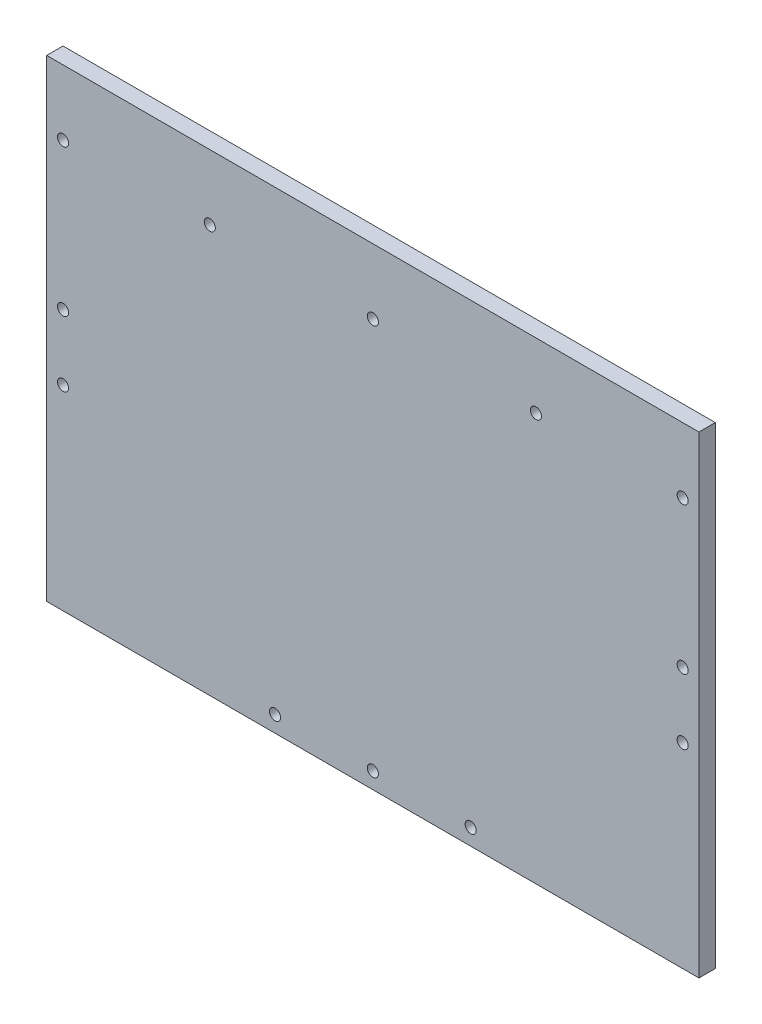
ISO-10303-21;
HEADER;
FILE_DESCRIPTION(('STEP AP214'),'2;1');
FILE_NAME('part.step','',(''),(''),'','','');
FILE_SCHEMA(('AUTOMOTIVE_DESIGN { 1 0 10303 214 1 1 1 1 }'));
ENDSEC;
DATA;
#1=APPLICATION_CONTEXT('core data for automotive mechanical design processes');
#2=APPLICATION_PROTOCOL_DEFINITION('international standard','automotive_design',2000,#1);
#3=PRODUCT_CONTEXT('',#1,'mechanical');
#4=PRODUCT('Part','Part','',(#3));
#5=PRODUCT_RELATED_PRODUCT_CATEGORY('part','',(#4));
#6=PRODUCT_DEFINITION_FORMATION('','',#4);
#7=PRODUCT_DEFINITION_CONTEXT('part definition',#1,'design');
#8=PRODUCT_DEFINITION('design','',#6,#7);
#9=PRODUCT_DEFINITION_SHAPE('','',#8);
#10=(LENGTH_UNIT() NAMED_UNIT(*) SI_UNIT(.MILLI.,.METRE.));
#11=(NAMED_UNIT(*) PLANE_ANGLE_UNIT() SI_UNIT($,.RADIAN.));
#12=(NAMED_UNIT(*) SI_UNIT($,.STERADIAN.) SOLID_ANGLE_UNIT());
#13=UNCERTAINTY_MEASURE_WITH_UNIT(LENGTH_MEASURE(1.E-05),#10,'distance_accuracy_value','');
#14=(GEOMETRIC_REPRESENTATION_CONTEXT(3) GLOBAL_UNCERTAINTY_ASSIGNED_CONTEXT((#13)) GLOBAL_UNIT_ASSIGNED_CONTEXT((#10,
#11,#12)) REPRESENTATION_CONTEXT('',''));
#15=CARTESIAN_POINT('',(0.,0.,0.));
#16=DIRECTION('',(0.,0.,1.));
#17=DIRECTION('',(1.,0.,0.));
#18=AXIS2_PLACEMENT_3D('',#15,#16,#17);
#19=CARTESIAN_POINT('',(0.,0.,0.));
#20=DIRECTION('',(0.,0.,1.));
#21=DIRECTION('',(1.,0.,0.));
#22=AXIS2_PLACEMENT_3D('',#19,#20,#21);
#23=PLANE('',#22);
#24=CARTESIAN_POINT('',(30.,-67.5,0.));
#25=DIRECTION('',(0.,0.,-1.));
#26=DIRECTION('',(-1.,0.,0.));
#27=AXIS2_PLACEMENT_3D('',#24,#25,#26);
#28=CIRCLE('',#27,3.3);
#29=CARTESIAN_POINT('',(26.7,-67.5,0.));
#30=VERTEX_POINT('',#29);
#31=EDGE_CURVE('E636',#30,#30,#28,.T.);
#32=ORIENTED_EDGE('',*,*,#31,.F.);
#33=EDGE_LOOP('',(#32));
#34=FACE_BOUND('',#33,.T.);
#35=CARTESIAN_POINT('',(0.,-67.5,0.));
#36=DIRECTION('',(0.,0.,-1.));
#37=DIRECTION('',(-1.,0.,0.));
#38=AXIS2_PLACEMENT_3D('',#35,#36,#37);
#39=CIRCLE('',#38,3.3);
#40=CARTESIAN_POINT('',(-3.3,-67.5,0.));
#41=VERTEX_POINT('',#40);
#42=EDGE_CURVE('E171',#41,#41,#39,.T.);
#43=ORIENTED_EDGE('',*,*,#42,.F.);
#44=EDGE_LOOP('',(#43));
#45=FACE_BOUND('',#44,.T.);
#46=CARTESIAN_POINT('',(-30.,-67.5,0.));
#47=DIRECTION('',(0.,0.,-1.));
#48=DIRECTION('',(-1.,0.,0.));
#49=AXIS2_PLACEMENT_3D('',#46,#47,#48);
#50=CIRCLE('',#49,3.3);
#51=CARTESIAN_POINT('',(-33.3,-67.5,0.));
#52=VERTEX_POINT('',#51);
#53=EDGE_CURVE('E164',#52,#52,#50,.T.);
#54=ORIENTED_EDGE('',*,*,#53,.F.);
#55=EDGE_LOOP('',(#54));
#56=FACE_BOUND('',#55,.T.);
#57=CARTESIAN_POINT('',(95.,7.49999999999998,0.));
#58=DIRECTION('',(0.,0.,-1.));
#59=DIRECTION('',(-1.,0.,0.));
#60=AXIS2_PLACEMENT_3D('',#57,#58,#59);
#61=CIRCLE('',#60,3.3);
#62=CARTESIAN_POINT('',(91.7,7.49999999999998,0.));
#63=VERTEX_POINT('',#62);
#64=EDGE_CURVE('E160',#63,#63,#61,.T.);
#65=ORIENTED_EDGE('',*,*,#64,.F.);
#66=EDGE_LOOP('',(#65));
#67=FACE_BOUND('',#66,.T.);
#68=CARTESIAN_POINT('',(95.,-12.5,0.));
#69=DIRECTION('',(0.,0.,-1.));
#70=DIRECTION('',(-1.,0.,0.));
#71=AXIS2_PLACEMENT_3D('',#68,#69,#70);
#72=CIRCLE('',#71,3.3);
#73=CARTESIAN_POINT('',(91.7,-12.5,0.));
#74=VERTEX_POINT('',#73);
#75=EDGE_CURVE('E156',#74,#74,#72,.T.);
#76=ORIENTED_EDGE('',*,*,#75,.F.);
#77=EDGE_LOOP('',(#76));
#78=FACE_BOUND('',#77,.T.);
#79=CARTESIAN_POINT('',(-95.,7.49999999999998,0.));
#80=DIRECTION('',(0.,0.,-1.));
#81=DIRECTION('',(-1.,0.,0.));
#82=AXIS2_PLACEMENT_3D('',#79,#80,#81);
#83=CIRCLE('',#82,3.3);
#84=CARTESIAN_POINT('',(-98.3,7.49999999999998,0.));
#85=VERTEX_POINT('',#84);
#86=EDGE_CURVE('E151',#85,#85,#83,.T.);
#87=ORIENTED_EDGE('',*,*,#86,.F.);
#88=EDGE_LOOP('',(#87));
#89=FACE_BOUND('',#88,.T.);
#90=CARTESIAN_POINT('',(-95.,-12.5,0.));
#91=DIRECTION('',(0.,0.,-1.));
#92=DIRECTION('',(-1.,0.,0.));
#93=AXIS2_PLACEMENT_3D('',#90,#91,#92);
#94=CIRCLE('',#93,3.3);
#95=CARTESIAN_POINT('',(-98.3,-12.5,0.));
#96=VERTEX_POINT('',#95);
#97=EDGE_CURVE('E146',#96,#96,#94,.T.);
#98=ORIENTED_EDGE('',*,*,#97,.F.);
#99=EDGE_LOOP('',(#98));
#100=FACE_BOUND('',#99,.T.);
#101=CARTESIAN_POINT('',(95.,52.5,0.));
#102=DIRECTION('',(0.,0.,-1.));
#103=DIRECTION('',(-1.,0.,0.));
#104=AXIS2_PLACEMENT_3D('',#101,#102,#103);
#105=CIRCLE('',#104,3.3);
#106=CARTESIAN_POINT('',(91.7,52.5,0.));
#107=VERTEX_POINT('',#106);
#108=EDGE_CURVE('E141',#107,#107,#105,.T.);
#109=ORIENTED_EDGE('',*,*,#108,.F.);
#110=EDGE_LOOP('',(#109));
#111=FACE_BOUND('',#110,.T.);
#112=CARTESIAN_POINT('',(50.,52.5,0.));
#113=DIRECTION('',(0.,0.,-1.));
#114=DIRECTION('',(-1.,0.,0.));
#115=AXIS2_PLACEMENT_3D('',#112,#113,#114);
#116=CIRCLE('',#115,3.3);
#117=CARTESIAN_POINT('',(46.7,52.5,0.));
#118=VERTEX_POINT('',#117);
#119=EDGE_CURVE('E136',#118,#118,#116,.T.);
#120=ORIENTED_EDGE('',*,*,#119,.F.);
#121=EDGE_LOOP('',(#120));
#122=FACE_BOUND('',#121,.T.);
#123=CARTESIAN_POINT('',(-95.,52.5,0.));
#124=DIRECTION('',(0.,0.,-1.));
#125=DIRECTION('',(-1.,0.,0.));
#126=AXIS2_PLACEMENT_3D('',#123,#124,#125);
#127=CIRCLE('',#126,3.3);
#128=CARTESIAN_POINT('',(-98.3,52.5,0.));
#129=VERTEX_POINT('',#128);
#130=EDGE_CURVE('E126',#129,#129,#127,.T.);
#131=ORIENTED_EDGE('',*,*,#130,.F.);
#132=EDGE_LOOP('',(#131));
#133=FACE_BOUND('',#132,.T.);
#134=CARTESIAN_POINT('',(0.,52.5,0.));
#135=DIRECTION('',(0.,0.,-1.));
#136=DIRECTION('',(-1.,0.,0.));
#137=AXIS2_PLACEMENT_3D('',#134,#135,#136);
#138=CIRCLE('',#137,3.3);
#139=CARTESIAN_POINT('',(-3.29999999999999,52.5,0.));
#140=VERTEX_POINT('',#139);
#141=EDGE_CURVE('E121',#140,#140,#138,.T.);
#142=ORIENTED_EDGE('',*,*,#141,.F.);
#143=EDGE_LOOP('',(#142));
#144=FACE_BOUND('',#143,.T.);
#145=DIRECTION('',(0.,1.,0.));
#146=VECTOR('',#145,1.);
#147=CARTESIAN_POINT('',(100.,72.5,0.));
#148=LINE('',#147,#146);
#149=CARTESIAN_POINT('',(100.,-72.5,0.));
#150=VERTEX_POINT('',#149);
#151=CARTESIAN_POINT('',(100.,72.5,0.));
#152=VERTEX_POINT('',#151);
#153=EDGE_CURVE('E106',#150,#152,#148,.T.);
#154=ORIENTED_EDGE('',*,*,#153,.F.);
#155=DIRECTION('',(1.,0.,0.));
#156=VECTOR('',#155,1.);
#157=CARTESIAN_POINT('',(-100.,-72.5,0.));
#158=LINE('',#157,#156);
#159=CARTESIAN_POINT('',(-100.,-72.5,0.));
#160=VERTEX_POINT('',#159);
#161=EDGE_CURVE('E81',#160,#150,#158,.T.);
#162=ORIENTED_EDGE('',*,*,#161,.F.);
#163=DIRECTION('',(0.,-1.,0.));
#164=VECTOR('',#163,1.);
#165=CARTESIAN_POINT('',(-100.,72.5,0.));
#166=LINE('',#165,#164);
#167=CARTESIAN_POINT('',(-100.,72.5,0.));
#168=VERTEX_POINT('',#167);
#169=EDGE_CURVE('E75',#168,#160,#166,.T.);
#170=ORIENTED_EDGE('',*,*,#169,.F.);
#171=DIRECTION('',(-1.,0.,0.));
#172=VECTOR('',#171,1.);
#173=CARTESIAN_POINT('',(-100.,72.5,0.));
#174=LINE('',#173,#172);
#175=EDGE_CURVE('E97',#152,#168,#174,.T.);
#176=ORIENTED_EDGE('',*,*,#175,.F.);
#177=EDGE_LOOP('',(#154,#162,#170,#176));
#178=FACE_BOUND('',#177,.T.);
#179=CARTESIAN_POINT('',(-50.,52.5,0.));
#180=DIRECTION('',(0.,0.,-1.));
#181=DIRECTION('',(-1.,0.,0.));
#182=AXIS2_PLACEMENT_3D('',#179,#180,#181);
#183=CIRCLE('',#182,3.3);
#184=CARTESIAN_POINT('',(-53.3,52.5,0.));
#185=VERTEX_POINT('',#184);
#186=EDGE_CURVE('E131',#185,#185,#183,.T.);
#187=ORIENTED_EDGE('',*,*,#186,.F.);
#188=EDGE_LOOP('',(#187));
#189=FACE_BOUND('',#188,.T.);
#190=ADVANCED_FACE('F39',(#34,#45,#56,#67,#78,#89,#100,#111,#122,#133,#144,#178,#189),#23,.F.);
#191=CARTESIAN_POINT('',(100.,72.5,5.));
#192=DIRECTION('',(-1.,0.,0.));
#193=DIRECTION('',(0.,0.,1.));
#194=AXIS2_PLACEMENT_3D('',#191,#192,#193);
#195=PLANE('',#194);
#196=ORIENTED_EDGE('',*,*,#153,.T.);
#197=DIRECTION('',(0.,0.,-1.));
#198=VECTOR('',#197,1.);
#199=CARTESIAN_POINT('',(100.,72.5,5.));
#200=LINE('',#199,#198);
#201=CARTESIAN_POINT('',(100.,72.5,5.));
#202=VERTEX_POINT('',#201);
#203=EDGE_CURVE('E11',#202,#152,#200,.T.);
#204=ORIENTED_EDGE('',*,*,#203,.F.);
#205=DIRECTION('',(0.,1.,0.));
#206=VECTOR('',#205,1.);
#207=CARTESIAN_POINT('',(100.,72.5,5.));
#208=LINE('',#207,#206);
#209=CARTESIAN_POINT('',(100.,-72.5,5.));
#210=VERTEX_POINT('',#209);
#211=EDGE_CURVE('E93',#210,#202,#208,.T.);
#212=ORIENTED_EDGE('',*,*,#211,.F.);
#213=DIRECTION('',(0.,0.,-1.));
#214=VECTOR('',#213,1.);
#215=CARTESIAN_POINT('',(100.,-72.5,5.));
#216=LINE('',#215,#214);
#217=EDGE_CURVE('E102',#210,#150,#216,.T.);
#218=ORIENTED_EDGE('',*,*,#217,.T.);
#219=EDGE_LOOP('',(#196,#204,#212,#218));
#220=FACE_BOUND('',#219,.T.);
#221=ADVANCED_FACE('F41',(#220),#195,.F.);
#222=CARTESIAN_POINT('',(-100.,72.5,5.));
#223=DIRECTION('',(0.,-1.,0.));
#224=DIRECTION('',(0.,0.,-1.));
#225=AXIS2_PLACEMENT_3D('',#222,#223,#224);
#226=PLANE('',#225);
#227=ORIENTED_EDGE('',*,*,#175,.T.);
#228=DIRECTION('',(0.,0.,-1.));
#229=VECTOR('',#228,1.);
#230=CARTESIAN_POINT('',(-100.,72.5,5.));
#231=LINE('',#230,#229);
#232=CARTESIAN_POINT('',(-100.,72.5,5.));
#233=VERTEX_POINT('',#232);
#234=EDGE_CURVE('E49',#233,#168,#231,.T.);
#235=ORIENTED_EDGE('',*,*,#234,.F.);
#236=DIRECTION('',(-1.,0.,0.));
#237=VECTOR('',#236,1.);
#238=CARTESIAN_POINT('',(-100.,72.5,5.));
#239=LINE('',#238,#237);
#240=EDGE_CURVE('E88',#202,#233,#239,.T.);
#241=ORIENTED_EDGE('',*,*,#240,.F.);
#242=ORIENTED_EDGE('',*,*,#203,.T.);
#243=EDGE_LOOP('',(#227,#235,#241,#242));
#244=FACE_BOUND('',#243,.T.);
#245=ADVANCED_FACE('F96',(#244),#226,.F.);
#246=CARTESIAN_POINT('',(-100.,72.5,5.));
#247=DIRECTION('',(1.,0.,0.));
#248=DIRECTION('',(0.,1.,0.));
#249=AXIS2_PLACEMENT_3D('',#246,#247,#248);
#250=PLANE('',#249);
#251=ORIENTED_EDGE('',*,*,#169,.T.);
#252=DIRECTION('',(0.,0.,-1.));
#253=VECTOR('',#252,1.);
#254=CARTESIAN_POINT('',(-100.,-72.5,5.));
#255=LINE('',#254,#253);
#256=CARTESIAN_POINT('',(-100.,-72.5,5.));
#257=VERTEX_POINT('',#256);
#258=EDGE_CURVE('E98',#257,#160,#255,.T.);
#259=ORIENTED_EDGE('',*,*,#258,.F.);
#260=DIRECTION('',(0.,-1.,0.));
#261=VECTOR('',#260,1.);
#262=CARTESIAN_POINT('',(-100.,72.5,5.));
#263=LINE('',#262,#261);
#264=EDGE_CURVE('E91',#233,#257,#263,.T.);
#265=ORIENTED_EDGE('',*,*,#264,.F.);
#266=ORIENTED_EDGE('',*,*,#234,.T.);
#267=EDGE_LOOP('',(#251,#259,#265,#266));
#268=FACE_BOUND('',#267,.T.);
#269=ADVANCED_FACE('F100',(#268),#250,.F.);
#270=CARTESIAN_POINT('',(-100.,-72.5,5.));
#271=DIRECTION('',(0.,1.,0.));
#272=DIRECTION('',(0.,0.,1.));
#273=AXIS2_PLACEMENT_3D('',#270,#271,#272);
#274=PLANE('',#273);
#275=ORIENTED_EDGE('',*,*,#161,.T.);
#276=ORIENTED_EDGE('',*,*,#217,.F.);
#277=DIRECTION('',(1.,0.,0.));
#278=VECTOR('',#277,1.);
#279=CARTESIAN_POINT('',(-100.,-72.5,5.));
#280=LINE('',#279,#278);
#281=EDGE_CURVE('E58',#257,#210,#280,.T.);
#282=ORIENTED_EDGE('',*,*,#281,.F.);
#283=ORIENTED_EDGE('',*,*,#258,.T.);
#284=EDGE_LOOP('',(#275,#276,#282,#283));
#285=FACE_BOUND('',#284,.T.);
#286=ADVANCED_FACE('F264',(#285),#274,.F.);
#287=CARTESIAN_POINT('',(0.,0.,5.));
#288=DIRECTION('',(0.,0.,1.));
#289=DIRECTION('',(1.,0.,0.));
#290=AXIS2_PLACEMENT_3D('',#287,#288,#289);
#291=PLANE('',#290);
#292=CARTESIAN_POINT('',(30.,-67.5,5.));
#293=DIRECTION('',(0.,0.,1.));
#294=DIRECTION('',(1.,0.,0.));
#295=AXIS2_PLACEMENT_3D('',#292,#293,#294);
#296=CIRCLE('',#295,1.69999999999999);
#297=CARTESIAN_POINT('',(31.7,-67.5,5.));
#298=VERTEX_POINT('',#297);
#299=EDGE_CURVE('E43',#298,#298,#296,.T.);
#300=ORIENTED_EDGE('',*,*,#299,.F.);
#301=EDGE_LOOP('',(#300));
#302=FACE_BOUND('',#301,.T.);
#303=CARTESIAN_POINT('',(0.,-67.5,5.));
#304=DIRECTION('',(0.,0.,1.));
#305=DIRECTION('',(1.,0.,0.));
#306=AXIS2_PLACEMENT_3D('',#303,#304,#305);
#307=CIRCLE('',#306,1.69999999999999);
#308=CARTESIAN_POINT('',(1.69999999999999,-67.5,5.));
#309=VERTEX_POINT('',#308);
#310=EDGE_CURVE('E162',#309,#309,#307,.T.);
#311=ORIENTED_EDGE('',*,*,#310,.F.);
#312=EDGE_LOOP('',(#311));
#313=FACE_BOUND('',#312,.T.);
#314=CARTESIAN_POINT('',(-30.,-67.5,5.));
#315=DIRECTION('',(0.,0.,1.));
#316=DIRECTION('',(1.,0.,0.));
#317=AXIS2_PLACEMENT_3D('',#314,#315,#316);
#318=CIRCLE('',#317,1.69999999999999);
#319=CARTESIAN_POINT('',(-28.3,-67.5,5.));
#320=VERTEX_POINT('',#319);
#321=EDGE_CURVE('E158',#320,#320,#318,.T.);
#322=ORIENTED_EDGE('',*,*,#321,.F.);
#323=EDGE_LOOP('',(#322));
#324=FACE_BOUND('',#323,.T.);
#325=CARTESIAN_POINT('',(95.,7.49999999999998,5.));
#326=DIRECTION('',(0.,0.,1.));
#327=DIRECTION('',(1.,0.,0.));
#328=AXIS2_PLACEMENT_3D('',#325,#326,#327);
#329=CIRCLE('',#328,1.69999999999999);
#330=CARTESIAN_POINT('',(96.7,7.49999999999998,5.));
#331=VERTEX_POINT('',#330);
#332=EDGE_CURVE('E153',#331,#331,#329,.T.);
#333=ORIENTED_EDGE('',*,*,#332,.F.);
#334=EDGE_LOOP('',(#333));
#335=FACE_BOUND('',#334,.T.);
#336=CARTESIAN_POINT('',(95.,-12.5,5.));
#337=DIRECTION('',(0.,0.,1.));
#338=DIRECTION('',(1.,0.,0.));
#339=AXIS2_PLACEMENT_3D('',#336,#337,#338);
#340=CIRCLE('',#339,1.69999999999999);
#341=CARTESIAN_POINT('',(96.7,-12.5,5.));
#342=VERTEX_POINT('',#341);
#343=EDGE_CURVE('E148',#342,#342,#340,.T.);
#344=ORIENTED_EDGE('',*,*,#343,.F.);
#345=EDGE_LOOP('',(#344));
#346=FACE_BOUND('',#345,.T.);
#347=CARTESIAN_POINT('',(-95.,7.49999999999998,5.));
#348=DIRECTION('',(0.,0.,1.));
#349=DIRECTION('',(1.,0.,0.));
#350=AXIS2_PLACEMENT_3D('',#347,#348,#349);
#351=CIRCLE('',#350,1.69999999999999);
#352=CARTESIAN_POINT('',(-93.3,7.49999999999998,5.));
#353=VERTEX_POINT('',#352);
#354=EDGE_CURVE('E143',#353,#353,#351,.T.);
#355=ORIENTED_EDGE('',*,*,#354,.F.);
#356=EDGE_LOOP('',(#355));
#357=FACE_BOUND('',#356,.T.);
#358=CARTESIAN_POINT('',(-95.,-12.5,5.));
#359=DIRECTION('',(0.,0.,1.));
#360=DIRECTION('',(1.,0.,0.));
#361=AXIS2_PLACEMENT_3D('',#358,#359,#360);
#362=CIRCLE('',#361,1.69999999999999);
#363=CARTESIAN_POINT('',(-93.3,-12.5,5.));
#364=VERTEX_POINT('',#363);
#365=EDGE_CURVE('E138',#364,#364,#362,.T.);
#366=ORIENTED_EDGE('',*,*,#365,.F.);
#367=EDGE_LOOP('',(#366));
#368=FACE_BOUND('',#367,.T.);
#369=CARTESIAN_POINT('',(95.,52.5,5.));
#370=DIRECTION('',(0.,0.,1.));
#371=DIRECTION('',(1.,0.,0.));
#372=AXIS2_PLACEMENT_3D('',#369,#370,#371);
#373=CIRCLE('',#372,1.69999999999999);
#374=CARTESIAN_POINT('',(96.7,52.5,5.));
#375=VERTEX_POINT('',#374);
#376=EDGE_CURVE('E133',#375,#375,#373,.T.);
#377=ORIENTED_EDGE('',*,*,#376,.F.);
#378=EDGE_LOOP('',(#377));
#379=FACE_BOUND('',#378,.T.);
#380=CARTESIAN_POINT('',(50.,52.5,5.));
#381=DIRECTION('',(0.,0.,1.));
#382=DIRECTION('',(1.,0.,0.));
#383=AXIS2_PLACEMENT_3D('',#380,#381,#382);
#384=CIRCLE('',#383,1.7);
#385=CARTESIAN_POINT('',(51.7,52.5,5.));
#386=VERTEX_POINT('',#385);
#387=EDGE_CURVE('E128',#386,#386,#384,.T.);
#388=ORIENTED_EDGE('',*,*,#387,.F.);
#389=EDGE_LOOP('',(#388));
#390=FACE_BOUND('',#389,.T.);
#391=CARTESIAN_POINT('',(-50.,52.5,5.));
#392=DIRECTION('',(0.,0.,1.));
#393=DIRECTION('',(1.,0.,0.));
#394=AXIS2_PLACEMENT_3D('',#391,#392,#393);
#395=CIRCLE('',#394,1.7);
#396=CARTESIAN_POINT('',(-48.3,52.5,5.));
#397=VERTEX_POINT('',#396);
#398=EDGE_CURVE('E123',#397,#397,#395,.T.);
#399=ORIENTED_EDGE('',*,*,#398,.F.);
#400=EDGE_LOOP('',(#399));
#401=FACE_BOUND('',#400,.T.);
#402=CARTESIAN_POINT('',(-95.,52.5,5.));
#403=DIRECTION('',(0.,0.,1.));
#404=DIRECTION('',(1.,0.,0.));
#405=AXIS2_PLACEMENT_3D('',#402,#403,#404);
#406=CIRCLE('',#405,1.69999999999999);
#407=CARTESIAN_POINT('',(-93.3,52.5,5.));
#408=VERTEX_POINT('',#407);
#409=EDGE_CURVE('E118',#408,#408,#406,.T.);
#410=ORIENTED_EDGE('',*,*,#409,.F.);
#411=EDGE_LOOP('',(#410));
#412=FACE_BOUND('',#411,.T.);
#413=CARTESIAN_POINT('',(0.,52.5,5.));
#414=DIRECTION('',(0.,0.,1.));
#415=DIRECTION('',(1.,0.,0.));
#416=AXIS2_PLACEMENT_3D('',#413,#414,#415);
#417=CIRCLE('',#416,1.7);
#418=CARTESIAN_POINT('',(1.70000000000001,52.5,5.));
#419=VERTEX_POINT('',#418);
#420=EDGE_CURVE('E109',#419,#419,#417,.T.);
#421=ORIENTED_EDGE('',*,*,#420,.F.);
#422=EDGE_LOOP('',(#421));
#423=FACE_BOUND('',#422,.T.);
#424=ORIENTED_EDGE('',*,*,#211,.T.);
#425=ORIENTED_EDGE('',*,*,#240,.T.);
#426=ORIENTED_EDGE('',*,*,#264,.T.);
#427=ORIENTED_EDGE('',*,*,#281,.T.);
#428=EDGE_LOOP('',(#424,#425,#426,#427));
#429=FACE_BOUND('',#428,.T.);
#430=ADVANCED_FACE('F89',(#302,#313,#324,#335,#346,#357,#368,#379,#390,#401,#412,#423,#429),
#291,.T.);
#431=CARTESIAN_POINT('',(0.,52.5,0.));
#432=DIRECTION('',(0.,0.,-1.));
#433=DIRECTION('',(-1.,0.,0.));
#434=AXIS2_PLACEMENT_3D('',#431,#432,#433);
#435=CYLINDRICAL_SURFACE('',#434,1.7);
#436=ORIENTED_EDGE('',*,*,#420,.T.);
#437=EDGE_LOOP('',(#436));
#438=FACE_BOUND('',#437,.T.);
#439=CARTESIAN_POINT('',(0.,52.5,1.6));
#440=DIRECTION('',(0.,0.,-1.));
#441=DIRECTION('',(-1.,0.,0.));
#442=AXIS2_PLACEMENT_3D('',#439,#440,#441);
#443=CIRCLE('',#442,1.7);
#444=CARTESIAN_POINT('',(-1.69999999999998,52.5,1.6));
#445=VERTEX_POINT('',#444);
#446=EDGE_CURVE('E117',#445,#445,#443,.T.);
#447=ORIENTED_EDGE('',*,*,#446,.T.);
#448=EDGE_LOOP('',(#447));
#449=FACE_BOUND('',#448,.T.);
#450=ADVANCED_FACE('F218',(#438,#449),#435,.F.);
#451=CARTESIAN_POINT('',(0.,52.5,0.));
#452=DIRECTION('',(0.,0.,-1.));
#453=DIRECTION('',(-1.,0.,0.));
#454=AXIS2_PLACEMENT_3D('',#451,#452,#453);
#455=CONICAL_SURFACE('',#454,3.3,0.785398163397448);
#456=ORIENTED_EDGE('',*,*,#446,.F.);
#457=EDGE_LOOP('',(#456));
#458=FACE_BOUND('',#457,.T.);
#459=ORIENTED_EDGE('',*,*,#141,.T.);
#460=EDGE_LOOP('',(#459));
#461=FACE_BOUND('',#460,.T.);
#462=ADVANCED_FACE('F220',(#458,#461),#455,.F.);
#463=CARTESIAN_POINT('',(-95.,52.5,0.));
#464=DIRECTION('',(0.,0.,-1.));
#465=DIRECTION('',(-1.,0.,0.));
#466=AXIS2_PLACEMENT_3D('',#463,#464,#465);
#467=CYLINDRICAL_SURFACE('',#466,1.69999999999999);
#468=ORIENTED_EDGE('',*,*,#409,.T.);
#469=EDGE_LOOP('',(#468));
#470=FACE_BOUND('',#469,.T.);
#471=CARTESIAN_POINT('',(-95.,52.5,1.6));
#472=DIRECTION('',(0.,0.,-1.));
#473=DIRECTION('',(-1.,0.,0.));
#474=AXIS2_PLACEMENT_3D('',#471,#472,#473);
#475=CIRCLE('',#474,1.69999999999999);
#476=CARTESIAN_POINT('',(-96.7,52.5,1.6));
#477=VERTEX_POINT('',#476);
#478=EDGE_CURVE('E122',#477,#477,#475,.T.);
#479=ORIENTED_EDGE('',*,*,#478,.T.);
#480=EDGE_LOOP('',(#479));
#481=FACE_BOUND('',#480,.T.);
#482=ADVANCED_FACE('F223',(#470,#481),#467,.F.);
#483=CARTESIAN_POINT('',(-95.,52.5,0.));
#484=DIRECTION('',(0.,0.,-1.));
#485=DIRECTION('',(-1.,0.,0.));
#486=AXIS2_PLACEMENT_3D('',#483,#484,#485);
#487=CONICAL_SURFACE('',#486,3.3,0.785398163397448);
#488=ORIENTED_EDGE('',*,*,#478,.F.);
#489=EDGE_LOOP('',(#488));
#490=FACE_BOUND('',#489,.T.);
#491=ORIENTED_EDGE('',*,*,#130,.T.);
#492=EDGE_LOOP('',(#491));
#493=FACE_BOUND('',#492,.T.);
#494=ADVANCED_FACE('F248',(#490,#493),#487,.F.);
#495=CARTESIAN_POINT('',(-50.,52.5,0.));
#496=DIRECTION('',(0.,0.,-1.));
#497=DIRECTION('',(-1.,0.,0.));
#498=AXIS2_PLACEMENT_3D('',#495,#496,#497);
#499=CYLINDRICAL_SURFACE('',#498,1.7);
#500=ORIENTED_EDGE('',*,*,#398,.T.);
#501=EDGE_LOOP('',(#500));
#502=FACE_BOUND('',#501,.T.);
#503=CARTESIAN_POINT('',(-50.,52.5,1.6));
#504=DIRECTION('',(0.,0.,-1.));
#505=DIRECTION('',(-1.,0.,0.));
#506=AXIS2_PLACEMENT_3D('',#503,#504,#505);
#507=CIRCLE('',#506,1.7);
#508=CARTESIAN_POINT('',(-51.7,52.5,1.6));
#509=VERTEX_POINT('',#508);
#510=EDGE_CURVE('E127',#509,#509,#507,.T.);
#511=ORIENTED_EDGE('',*,*,#510,.T.);
#512=EDGE_LOOP('',(#511));
#513=FACE_BOUND('',#512,.T.);
#514=ADVANCED_FACE('F238',(#502,#513),#499,.F.);
#515=CARTESIAN_POINT('',(-50.,52.5,0.));
#516=DIRECTION('',(0.,0.,-1.));
#517=DIRECTION('',(-1.,0.,0.));
#518=AXIS2_PLACEMENT_3D('',#515,#516,#517);
#519=CONICAL_SURFACE('',#518,3.3,0.785398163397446);
#520=ORIENTED_EDGE('',*,*,#510,.F.);
#521=EDGE_LOOP('',(#520));
#522=FACE_BOUND('',#521,.T.);
#523=ORIENTED_EDGE('',*,*,#186,.T.);
#524=EDGE_LOOP('',(#523));
#525=FACE_BOUND('',#524,.T.);
#526=ADVANCED_FACE('F235',(#522,#525),#519,.F.);
#527=CARTESIAN_POINT('',(50.,52.5,0.));
#528=DIRECTION('',(0.,0.,-1.));
#529=DIRECTION('',(-1.,0.,0.));
#530=AXIS2_PLACEMENT_3D('',#527,#528,#529);
#531=CYLINDRICAL_SURFACE('',#530,1.7);
#532=ORIENTED_EDGE('',*,*,#387,.T.);
#533=EDGE_LOOP('',(#532));
#534=FACE_BOUND('',#533,.T.);
#535=CARTESIAN_POINT('',(50.,52.5,1.6));
#536=DIRECTION('',(0.,0.,-1.));
#537=DIRECTION('',(-1.,0.,0.));
#538=AXIS2_PLACEMENT_3D('',#535,#536,#537);
#539=CIRCLE('',#538,1.7);
#540=CARTESIAN_POINT('',(48.3,52.5,1.6));
#541=VERTEX_POINT('',#540);
#542=EDGE_CURVE('E132',#541,#541,#539,.T.);
#543=ORIENTED_EDGE('',*,*,#542,.T.);
#544=EDGE_LOOP('',(#543));
#545=FACE_BOUND('',#544,.T.);
#546=ADVANCED_FACE('F237',(#534,#545),#531,.F.);
#547=CARTESIAN_POINT('',(50.,52.5,0.));
#548=DIRECTION('',(0.,0.,-1.));
#549=DIRECTION('',(-1.,0.,0.));
#550=AXIS2_PLACEMENT_3D('',#547,#548,#549);
#551=CONICAL_SURFACE('',#550,3.3,0.785398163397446);
#552=ORIENTED_EDGE('',*,*,#542,.F.);
#553=EDGE_LOOP('',(#552));
#554=FACE_BOUND('',#553,.T.);
#555=ORIENTED_EDGE('',*,*,#119,.T.);
#556=EDGE_LOOP('',(#555));
#557=FACE_BOUND('',#556,.T.);
#558=ADVANCED_FACE('F245',(#554,#557),#551,.F.);
#559=CARTESIAN_POINT('',(95.,52.5,0.));
#560=DIRECTION('',(0.,0.,-1.));
#561=DIRECTION('',(-1.,0.,0.));
#562=AXIS2_PLACEMENT_3D('',#559,#560,#561);
#563=CYLINDRICAL_SURFACE('',#562,1.69999999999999);
#564=ORIENTED_EDGE('',*,*,#376,.T.);
#565=EDGE_LOOP('',(#564));
#566=FACE_BOUND('',#565,.T.);
#567=CARTESIAN_POINT('',(95.,52.5,1.6));
#568=DIRECTION('',(0.,0.,-1.));
#569=DIRECTION('',(-1.,0.,0.));
#570=AXIS2_PLACEMENT_3D('',#567,#568,#569);
#571=CIRCLE('',#570,1.69999999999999);
#572=CARTESIAN_POINT('',(93.3,52.5,1.6));
#573=VERTEX_POINT('',#572);
#574=EDGE_CURVE('E137',#573,#573,#571,.T.);
#575=ORIENTED_EDGE('',*,*,#574,.T.);
#576=EDGE_LOOP('',(#575));
#577=FACE_BOUND('',#576,.T.);
#578=ADVANCED_FACE('F452',(#566,#577),#563,.F.);
#579=CARTESIAN_POINT('',(95.,52.5,0.));
#580=DIRECTION('',(0.,0.,-1.));
#581=DIRECTION('',(-1.,0.,0.));
#582=AXIS2_PLACEMENT_3D('',#579,#580,#581);
#583=CONICAL_SURFACE('',#582,3.3,0.785398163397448);
#584=ORIENTED_EDGE('',*,*,#574,.F.);
#585=EDGE_LOOP('',(#584));
#586=FACE_BOUND('',#585,.T.);
#587=ORIENTED_EDGE('',*,*,#108,.T.);
#588=EDGE_LOOP('',(#587));
#589=FACE_BOUND('',#588,.T.);
#590=ADVANCED_FACE('F442',(#586,#589),#583,.F.);
#591=CARTESIAN_POINT('',(-95.,-12.5,0.));
#592=DIRECTION('',(0.,0.,-1.));
#593=DIRECTION('',(-1.,0.,0.));
#594=AXIS2_PLACEMENT_3D('',#591,#592,#593);
#595=CYLINDRICAL_SURFACE('',#594,1.69999999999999);
#596=ORIENTED_EDGE('',*,*,#365,.T.);
#597=EDGE_LOOP('',(#596));
#598=FACE_BOUND('',#597,.T.);
#599=CARTESIAN_POINT('',(-95.,-12.5,1.60000000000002));
#600=DIRECTION('',(0.,0.,-1.));
#601=DIRECTION('',(-1.,0.,0.));
#602=AXIS2_PLACEMENT_3D('',#599,#600,#601);
#603=CIRCLE('',#602,1.69999999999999);
#604=CARTESIAN_POINT('',(-96.7,-12.5,1.60000000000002));
#605=VERTEX_POINT('',#604);
#606=EDGE_CURVE('E142',#605,#605,#603,.T.);
#607=ORIENTED_EDGE('',*,*,#606,.T.);
#608=EDGE_LOOP('',(#607));
#609=FACE_BOUND('',#608,.T.);
#610=ADVANCED_FACE('F432',(#598,#609),#595,.F.);
#611=CARTESIAN_POINT('',(-95.,-12.5,0.));
#612=DIRECTION('',(0.,0.,-1.));
#613=DIRECTION('',(-1.,0.,0.));
#614=AXIS2_PLACEMENT_3D('',#611,#612,#613);
#615=CONICAL_SURFACE('',#614,3.3,0.785398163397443);
#616=ORIENTED_EDGE('',*,*,#606,.F.);
#617=EDGE_LOOP('',(#616));
#618=FACE_BOUND('',#617,.T.);
#619=ORIENTED_EDGE('',*,*,#97,.T.);
#620=EDGE_LOOP('',(#619));
#621=FACE_BOUND('',#620,.T.);
#622=ADVANCED_FACE('F422',(#618,#621),#615,.F.);
#623=CARTESIAN_POINT('',(-95.,7.49999999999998,0.));
#624=DIRECTION('',(0.,0.,-1.));
#625=DIRECTION('',(-1.,0.,0.));
#626=AXIS2_PLACEMENT_3D('',#623,#624,#625);
#627=CYLINDRICAL_SURFACE('',#626,1.69999999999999);
#628=ORIENTED_EDGE('',*,*,#354,.T.);
#629=EDGE_LOOP('',(#628));
#630=FACE_BOUND('',#629,.T.);
#631=CARTESIAN_POINT('',(-95.,7.49999999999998,1.60000000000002));
#632=DIRECTION('',(0.,0.,-1.));
#633=DIRECTION('',(-1.,0.,0.));
#634=AXIS2_PLACEMENT_3D('',#631,#632,#633);
#635=CIRCLE('',#634,1.69999999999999);
#636=CARTESIAN_POINT('',(-96.7,7.49999999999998,1.60000000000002));
#637=VERTEX_POINT('',#636);
#638=EDGE_CURVE('E147',#637,#637,#635,.T.);
#639=ORIENTED_EDGE('',*,*,#638,.T.);
#640=EDGE_LOOP('',(#639));
#641=FACE_BOUND('',#640,.T.);
#642=ADVANCED_FACE('F412',(#630,#641),#627,.F.);
#643=CARTESIAN_POINT('',(-95.,7.49999999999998,0.));
#644=DIRECTION('',(0.,0.,-1.));
#645=DIRECTION('',(-1.,0.,0.));
#646=AXIS2_PLACEMENT_3D('',#643,#644,#645);
#647=CONICAL_SURFACE('',#646,3.3,0.785398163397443);
#648=ORIENTED_EDGE('',*,*,#638,.F.);
#649=EDGE_LOOP('',(#648));
#650=FACE_BOUND('',#649,.T.);
#651=ORIENTED_EDGE('',*,*,#86,.T.);
#652=EDGE_LOOP('',(#651));
#653=FACE_BOUND('',#652,.T.);
#654=ADVANCED_FACE('F402',(#650,#653),#647,.F.);
#655=CARTESIAN_POINT('',(95.,-12.5,0.));
#656=DIRECTION('',(0.,0.,-1.));
#657=DIRECTION('',(-1.,0.,0.));
#658=AXIS2_PLACEMENT_3D('',#655,#656,#657);
#659=CYLINDRICAL_SURFACE('',#658,1.69999999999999);
#660=ORIENTED_EDGE('',*,*,#343,.T.);
#661=EDGE_LOOP('',(#660));
#662=FACE_BOUND('',#661,.T.);
#663=CARTESIAN_POINT('',(95.,-12.5,1.60000000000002));
#664=DIRECTION('',(0.,0.,-1.));
#665=DIRECTION('',(-1.,0.,0.));
#666=AXIS2_PLACEMENT_3D('',#663,#664,#665);
#667=CIRCLE('',#666,1.69999999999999);
#668=CARTESIAN_POINT('',(93.3,-12.5,1.60000000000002));
#669=VERTEX_POINT('',#668);
#670=EDGE_CURVE('E152',#669,#669,#667,.T.);
#671=ORIENTED_EDGE('',*,*,#670,.T.);
#672=EDGE_LOOP('',(#671));
#673=FACE_BOUND('',#672,.T.);
#674=ADVANCED_FACE('F392',(#662,#673),#659,.F.);
#675=CARTESIAN_POINT('',(95.,-12.5,0.));
#676=DIRECTION('',(0.,0.,-1.));
#677=DIRECTION('',(-1.,0.,0.));
#678=AXIS2_PLACEMENT_3D('',#675,#676,#677);
#679=CONICAL_SURFACE('',#678,3.3,0.785398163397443);
#680=ORIENTED_EDGE('',*,*,#670,.F.);
#681=EDGE_LOOP('',(#680));
#682=FACE_BOUND('',#681,.T.);
#683=ORIENTED_EDGE('',*,*,#75,.T.);
#684=EDGE_LOOP('',(#683));
#685=FACE_BOUND('',#684,.T.);
#686=ADVANCED_FACE('F383',(#682,#685),#679,.F.);
#687=CARTESIAN_POINT('',(95.,7.49999999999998,0.));
#688=DIRECTION('',(0.,0.,-1.));
#689=DIRECTION('',(-1.,0.,0.));
#690=AXIS2_PLACEMENT_3D('',#687,#688,#689);
#691=CYLINDRICAL_SURFACE('',#690,1.69999999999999);
#692=ORIENTED_EDGE('',*,*,#332,.T.);
#693=EDGE_LOOP('',(#692));
#694=FACE_BOUND('',#693,.T.);
#695=CARTESIAN_POINT('',(95.,7.49999999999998,1.60000000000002));
#696=DIRECTION('',(0.,0.,-1.));
#697=DIRECTION('',(-1.,0.,0.));
#698=AXIS2_PLACEMENT_3D('',#695,#696,#697);
#699=CIRCLE('',#698,1.69999999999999);
#700=CARTESIAN_POINT('',(93.3,7.49999999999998,1.60000000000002));
#701=VERTEX_POINT('',#700);
#702=EDGE_CURVE('E157',#701,#701,#699,.T.);
#703=ORIENTED_EDGE('',*,*,#702,.T.);
#704=EDGE_LOOP('',(#703));
#705=FACE_BOUND('',#704,.T.);
#706=ADVANCED_FACE('F374',(#694,#705),#691,.F.);
#707=CARTESIAN_POINT('',(95.,7.49999999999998,0.));
#708=DIRECTION('',(0.,0.,-1.));
#709=DIRECTION('',(-1.,0.,0.));
#710=AXIS2_PLACEMENT_3D('',#707,#708,#709);
#711=CONICAL_SURFACE('',#710,3.3,0.785398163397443);
#712=ORIENTED_EDGE('',*,*,#702,.F.);
#713=EDGE_LOOP('',(#712));
#714=FACE_BOUND('',#713,.T.);
#715=ORIENTED_EDGE('',*,*,#64,.T.);
#716=EDGE_LOOP('',(#715));
#717=FACE_BOUND('',#716,.T.);
#718=ADVANCED_FACE('F289',(#714,#717),#711,.F.);
#719=CARTESIAN_POINT('',(-30.,-67.5,0.));
#720=DIRECTION('',(0.,0.,-1.));
#721=DIRECTION('',(-1.,0.,0.));
#722=AXIS2_PLACEMENT_3D('',#719,#720,#721);
#723=CYLINDRICAL_SURFACE('',#722,1.69999999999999);
#724=ORIENTED_EDGE('',*,*,#321,.T.);
#725=EDGE_LOOP('',(#724));
#726=FACE_BOUND('',#725,.T.);
#727=CARTESIAN_POINT('',(-30.,-67.5,1.60000000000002));
#728=DIRECTION('',(0.,0.,-1.));
#729=DIRECTION('',(-1.,0.,0.));
#730=AXIS2_PLACEMENT_3D('',#727,#728,#729);
#731=CIRCLE('',#730,1.69999999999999);
#732=CARTESIAN_POINT('',(-31.7,-67.5,1.60000000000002));
#733=VERTEX_POINT('',#732);
#734=EDGE_CURVE('E161',#733,#733,#731,.T.);
#735=ORIENTED_EDGE('',*,*,#734,.T.);
#736=EDGE_LOOP('',(#735));
#737=FACE_BOUND('',#736,.T.);
#738=ADVANCED_FACE('F301',(#726,#737),#723,.F.);
#739=CARTESIAN_POINT('',(-30.,-67.5,0.));
#740=DIRECTION('',(0.,0.,-1.));
#741=DIRECTION('',(-1.,0.,0.));
#742=AXIS2_PLACEMENT_3D('',#739,#740,#741);
#743=CONICAL_SURFACE('',#742,3.3,0.785398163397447);
#744=ORIENTED_EDGE('',*,*,#734,.F.);
#745=EDGE_LOOP('',(#744));
#746=FACE_BOUND('',#745,.T.);
#747=ORIENTED_EDGE('',*,*,#53,.T.);
#748=EDGE_LOOP('',(#747));
#749=FACE_BOUND('',#748,.T.);
#750=ADVANCED_FACE('F306',(#746,#749),#743,.F.);
#751=CARTESIAN_POINT('',(0.,-67.5,0.));
#752=DIRECTION('',(0.,0.,-1.));
#753=DIRECTION('',(-1.,0.,0.));
#754=AXIS2_PLACEMENT_3D('',#751,#752,#753);
#755=CYLINDRICAL_SURFACE('',#754,1.69999999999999);
#756=ORIENTED_EDGE('',*,*,#310,.T.);
#757=EDGE_LOOP('',(#756));
#758=FACE_BOUND('',#757,.T.);
#759=CARTESIAN_POINT('',(0.,-67.5,1.60000000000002));
#760=DIRECTION('',(0.,0.,-1.));
#761=DIRECTION('',(-1.,0.,0.));
#762=AXIS2_PLACEMENT_3D('',#759,#760,#761);
#763=CIRCLE('',#762,1.69999999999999);
#764=CARTESIAN_POINT('',(-1.69999999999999,-67.5,1.60000000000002));
#765=VERTEX_POINT('',#764);
#766=EDGE_CURVE('E165',#765,#765,#763,.T.);
#767=ORIENTED_EDGE('',*,*,#766,.T.);
#768=EDGE_LOOP('',(#767));
#769=FACE_BOUND('',#768,.T.);
#770=ADVANCED_FACE('F317',(#758,#769),#755,.F.);
#771=CARTESIAN_POINT('',(0.,-67.5,0.));
#772=DIRECTION('',(0.,0.,-1.));
#773=DIRECTION('',(-1.,0.,0.));
#774=AXIS2_PLACEMENT_3D('',#771,#772,#773);
#775=CONICAL_SURFACE('',#774,3.3,0.785398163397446);
#776=ORIENTED_EDGE('',*,*,#766,.F.);
#777=EDGE_LOOP('',(#776));
#778=FACE_BOUND('',#777,.T.);
#779=ORIENTED_EDGE('',*,*,#42,.T.);
#780=EDGE_LOOP('',(#779));
#781=FACE_BOUND('',#780,.T.);
#782=ADVANCED_FACE('F328',(#778,#781),#775,.F.);
#783=CARTESIAN_POINT('',(30.,-67.5,0.));
#784=DIRECTION('',(0.,0.,-1.));
#785=DIRECTION('',(-1.,0.,0.));
#786=AXIS2_PLACEMENT_3D('',#783,#784,#785);
#787=CYLINDRICAL_SURFACE('',#786,1.69999999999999);
#788=ORIENTED_EDGE('',*,*,#299,.T.);
#789=EDGE_LOOP('',(#788));
#790=FACE_BOUND('',#789,.T.);
#791=CARTESIAN_POINT('',(30.,-67.5,1.60000000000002));
#792=DIRECTION('',(0.,0.,-1.));
#793=DIRECTION('',(-1.,0.,0.));
#794=AXIS2_PLACEMENT_3D('',#791,#792,#793);
#795=CIRCLE('',#794,1.69999999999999);
#796=CARTESIAN_POINT('',(28.3,-67.5,1.60000000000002));
#797=VERTEX_POINT('',#796);
#798=EDGE_CURVE('E633',#797,#797,#795,.T.);
#799=ORIENTED_EDGE('',*,*,#798,.T.);
#800=EDGE_LOOP('',(#799));
#801=FACE_BOUND('',#800,.T.);
#802=ADVANCED_FACE('F338',(#790,#801),#787,.F.);
#803=CARTESIAN_POINT('',(30.,-67.5,0.));
#804=DIRECTION('',(0.,0.,-1.));
#805=DIRECTION('',(-1.,0.,0.));
#806=AXIS2_PLACEMENT_3D('',#803,#804,#805);
#807=CONICAL_SURFACE('',#806,3.3,0.785398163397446);
#808=ORIENTED_EDGE('',*,*,#798,.F.);
#809=EDGE_LOOP('',(#808));
#810=FACE_BOUND('',#809,.T.);
#811=ORIENTED_EDGE('',*,*,#31,.T.);
#812=EDGE_LOOP('',(#811));
#813=FACE_BOUND('',#812,.T.);
#814=ADVANCED_FACE('F349',(#810,#813),#807,.F.);
#815=CLOSED_SHELL('',(#190,#221,#245,#269,#286,#430,#450,#462,#482,#494,#514,#526,#546,#558,
#578,#590,#610,#622,#642,#654,#674,#686,#706,#718,#738,#750,#770,#782,#802,#814));
#816=MANIFOLD_SOLID_BREP('B2',#815);
#817=ADVANCED_BREP_SHAPE_REPRESENTATION('',(#18,#816),#14);
#818=SHAPE_DEFINITION_REPRESENTATION(#9,#817);
ENDSEC;
END-ISO-10303-21;
